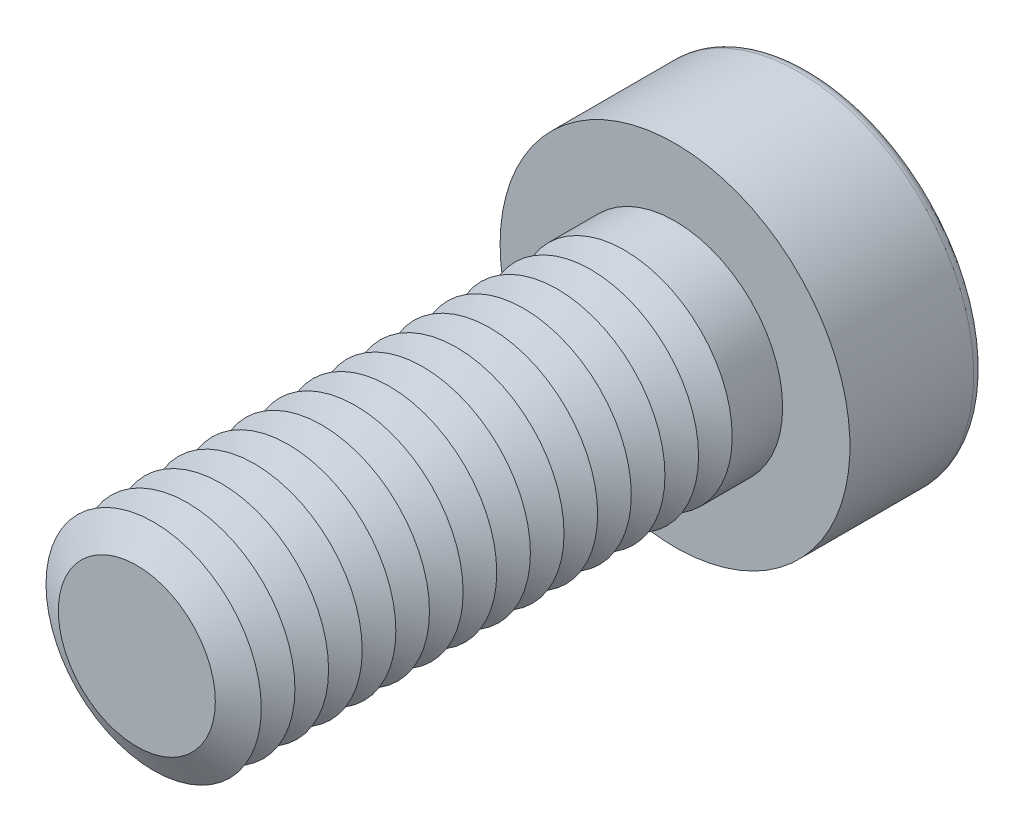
ISO-10303-21;
HEADER;
FILE_DESCRIPTION(('STEP AP214'),'2;1');
FILE_NAME('part.step','',(''),(''),'','','');
FILE_SCHEMA(('AUTOMOTIVE_DESIGN { 1 0 10303 214 1 1 1 1 }'));
ENDSEC;
DATA;
#1=APPLICATION_CONTEXT('core data for automotive mechanical design processes');
#2=APPLICATION_PROTOCOL_DEFINITION('international standard','automotive_design',2000,#1);
#3=PRODUCT_CONTEXT('',#1,'mechanical');
#4=PRODUCT('Part','Part','',(#3));
#5=PRODUCT_RELATED_PRODUCT_CATEGORY('part','',(#4));
#6=PRODUCT_DEFINITION_FORMATION('','',#4);
#7=PRODUCT_DEFINITION_CONTEXT('part definition',#1,'design');
#8=PRODUCT_DEFINITION('design','',#6,#7);
#9=PRODUCT_DEFINITION_SHAPE('','',#8);
#10=(LENGTH_UNIT() NAMED_UNIT(*) SI_UNIT(.MILLI.,.METRE.));
#11=(NAMED_UNIT(*) PLANE_ANGLE_UNIT() SI_UNIT($,.RADIAN.));
#12=(NAMED_UNIT(*) SI_UNIT($,.STERADIAN.) SOLID_ANGLE_UNIT());
#13=UNCERTAINTY_MEASURE_WITH_UNIT(LENGTH_MEASURE(1.E-05),#10,'distance_accuracy_value','');
#14=(GEOMETRIC_REPRESENTATION_CONTEXT(3) GLOBAL_UNCERTAINTY_ASSIGNED_CONTEXT((#13)) GLOBAL_UNIT_ASSIGNED_CONTEXT((#10,
#11,#12)) REPRESENTATION_CONTEXT('',''));
#15=CARTESIAN_POINT('',(0.,0.,0.));
#16=DIRECTION('',(0.,0.,1.));
#17=DIRECTION('',(1.,0.,0.));
#18=AXIS2_PLACEMENT_3D('',#15,#16,#17);
#19=CARTESIAN_POINT('',(0.,0.,15.625));
#20=DIRECTION('',(0.,0.,1.));
#21=DIRECTION('',(1.,0.,0.));
#22=AXIS2_PLACEMENT_3D('',#19,#20,#21);
#23=CONICAL_SURFACE('',#22,4.,1.0471975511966);
#24=CARTESIAN_POINT('',(0.,0.,15.));
#25=DIRECTION('',(0.,0.,1.));
#26=DIRECTION('',(1.,0.,0.));
#27=AXIS2_PLACEMENT_3D('',#24,#25,#26);
#28=CIRCLE('',#27,2.91746824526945);
#29=CARTESIAN_POINT('',(2.91746824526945,0.,15.));
#30=VERTEX_POINT('',#29);
#31=EDGE_CURVE('E313',#30,#30,#28,.T.);
#32=ORIENTED_EDGE('',*,*,#31,.T.);
#33=EDGE_LOOP('',(#32));
#34=FACE_BOUND('',#33,.T.);
#35=CARTESIAN_POINT('',(0.,0.,15.625));
#36=DIRECTION('',(0.,0.,1.));
#37=DIRECTION('',(1.,0.,0.));
#38=AXIS2_PLACEMENT_3D('',#35,#36,#37);
#39=CIRCLE('',#38,4.);
#40=CARTESIAN_POINT('',(4.,0.,15.625));
#41=VERTEX_POINT('',#40);
#42=EDGE_CURVE('E316',#41,#41,#39,.T.);
#43=ORIENTED_EDGE('',*,*,#42,.F.);
#44=EDGE_LOOP('',(#43));
#45=FACE_BOUND('',#44,.T.);
#46=ADVANCED_FACE('F39',(#34,#45),#23,.T.);
#47=CARTESIAN_POINT('',(0.,0.,15.));
#48=DIRECTION('',(0.,0.,-1.));
#49=DIRECTION('',(-1.,0.,0.));
#50=AXIS2_PLACEMENT_3D('',#47,#48,#49);
#51=CONICAL_SURFACE('',#50,2.91746824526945,1.0471975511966);
#52=CARTESIAN_POINT('',(0.,0.,14.375));
#53=DIRECTION('',(0.,0.,1.));
#54=DIRECTION('',(1.,0.,0.));
#55=AXIS2_PLACEMENT_3D('',#52,#53,#54);
#56=CIRCLE('',#55,4.);
#57=CARTESIAN_POINT('',(4.,0.,14.375));
#58=VERTEX_POINT('',#57);
#59=EDGE_CURVE('E324',#58,#58,#56,.T.);
#60=ORIENTED_EDGE('',*,*,#59,.T.);
#61=EDGE_LOOP('',(#60));
#62=FACE_BOUND('',#61,.T.);
#63=ORIENTED_EDGE('',*,*,#31,.F.);
#64=EDGE_LOOP('',(#63));
#65=FACE_BOUND('',#64,.T.);
#66=ADVANCED_FACE('F244',(#62,#65),#51,.T.);
#67=CARTESIAN_POINT('',(0.,0.,20.));
#68=DIRECTION('',(0.,0.,1.));
#69=DIRECTION('',(1.,0.,0.));
#70=AXIS2_PLACEMENT_3D('',#67,#68,#69);
#71=PLANE('',#70);
#72=CARTESIAN_POINT('',(0.,0.,20.));
#73=DIRECTION('',(0.,0.,1.));
#74=DIRECTION('',(1.,0.,0.));
#75=AXIS2_PLACEMENT_3D('',#72,#73,#74);
#76=CIRCLE('',#75,2.91746824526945);
#77=CARTESIAN_POINT('',(2.91746824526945,0.,20.));
#78=VERTEX_POINT('',#77);
#79=EDGE_CURVE('E173',#78,#78,#76,.T.);
#80=ORIENTED_EDGE('',*,*,#79,.T.);
#81=EDGE_LOOP('',(#80));
#82=FACE_BOUND('',#81,.T.);
#83=ADVANCED_FACE('F250',(#82),#71,.T.);
#84=CARTESIAN_POINT('',(0.,0.,20.));
#85=DIRECTION('',(0.,0.,-1.));
#86=DIRECTION('',(-1.,0.,0.));
#87=AXIS2_PLACEMENT_3D('',#84,#85,#86);
#88=CONICAL_SURFACE('',#87,2.91746824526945,1.0471975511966);
#89=CARTESIAN_POINT('',(0.,0.,19.375));
#90=DIRECTION('',(0.,0.,1.));
#91=DIRECTION('',(1.,0.,0.));
#92=AXIS2_PLACEMENT_3D('',#89,#90,#91);
#93=CIRCLE('',#92,4.);
#94=CARTESIAN_POINT('',(4.,0.,19.375));
#95=VERTEX_POINT('',#94);
#96=EDGE_CURVE('E290',#95,#95,#93,.T.);
#97=ORIENTED_EDGE('',*,*,#96,.T.);
#98=EDGE_LOOP('',(#97));
#99=FACE_BOUND('',#98,.T.);
#100=ORIENTED_EDGE('',*,*,#79,.F.);
#101=EDGE_LOOP('',(#100));
#102=FACE_BOUND('',#101,.T.);
#103=ADVANCED_FACE('F198',(#99,#102),#88,.T.);
#104=CARTESIAN_POINT('',(0.,0.,19.375));
#105=DIRECTION('',(0.,0.,1.));
#106=DIRECTION('',(1.,0.,0.));
#107=AXIS2_PLACEMENT_3D('',#104,#105,#106);
#108=CONICAL_SURFACE('',#107,4.,1.0471975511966);
#109=CARTESIAN_POINT('',(0.,0.,18.75));
#110=DIRECTION('',(0.,0.,1.));
#111=DIRECTION('',(1.,0.,0.));
#112=AXIS2_PLACEMENT_3D('',#109,#110,#111);
#113=CIRCLE('',#112,2.91746824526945);
#114=CARTESIAN_POINT('',(2.91746824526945,0.,18.75));
#115=VERTEX_POINT('',#114);
#116=EDGE_CURVE('E287',#115,#115,#113,.T.);
#117=ORIENTED_EDGE('',*,*,#116,.T.);
#118=EDGE_LOOP('',(#117));
#119=FACE_BOUND('',#118,.T.);
#120=ORIENTED_EDGE('',*,*,#96,.F.);
#121=EDGE_LOOP('',(#120));
#122=FACE_BOUND('',#121,.T.);
#123=ADVANCED_FACE('F276',(#119,#122),#108,.T.);
#124=CARTESIAN_POINT('',(0.,0.,18.75));
#125=DIRECTION('',(0.,0.,-1.));
#126=DIRECTION('',(-1.,0.,0.));
#127=AXIS2_PLACEMENT_3D('',#124,#125,#126);
#128=CONICAL_SURFACE('',#127,2.91746824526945,1.0471975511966);
#129=CARTESIAN_POINT('',(0.,0.,18.125));
#130=DIRECTION('',(0.,0.,1.));
#131=DIRECTION('',(1.,0.,0.));
#132=AXIS2_PLACEMENT_3D('',#129,#130,#131);
#133=CIRCLE('',#132,4.);
#134=CARTESIAN_POINT('',(4.,0.,18.125));
#135=VERTEX_POINT('',#134);
#136=EDGE_CURVE('E299',#135,#135,#133,.T.);
#137=ORIENTED_EDGE('',*,*,#136,.T.);
#138=EDGE_LOOP('',(#137));
#139=FACE_BOUND('',#138,.T.);
#140=ORIENTED_EDGE('',*,*,#116,.F.);
#141=EDGE_LOOP('',(#140));
#142=FACE_BOUND('',#141,.T.);
#143=ADVANCED_FACE('F273',(#139,#142),#128,.T.);
#144=CARTESIAN_POINT('',(0.,0.,18.125));
#145=DIRECTION('',(0.,0.,1.));
#146=DIRECTION('',(1.,0.,0.));
#147=AXIS2_PLACEMENT_3D('',#144,#145,#146);
#148=CONICAL_SURFACE('',#147,4.,1.0471975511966);
#149=CARTESIAN_POINT('',(0.,0.,17.5));
#150=DIRECTION('',(0.,0.,1.));
#151=DIRECTION('',(1.,0.,0.));
#152=AXIS2_PLACEMENT_3D('',#149,#150,#151);
#153=CIRCLE('',#152,2.91746824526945);
#154=CARTESIAN_POINT('',(2.91746824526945,0.,17.5));
#155=VERTEX_POINT('',#154);
#156=EDGE_CURVE('E292',#155,#155,#153,.T.);
#157=ORIENTED_EDGE('',*,*,#156,.T.);
#158=EDGE_LOOP('',(#157));
#159=FACE_BOUND('',#158,.T.);
#160=ORIENTED_EDGE('',*,*,#136,.F.);
#161=EDGE_LOOP('',(#160));
#162=FACE_BOUND('',#161,.T.);
#163=ADVANCED_FACE('F269',(#159,#162),#148,.T.);
#164=CARTESIAN_POINT('',(0.,0.,17.5));
#165=DIRECTION('',(0.,0.,-1.));
#166=DIRECTION('',(-1.,0.,0.));
#167=AXIS2_PLACEMENT_3D('',#164,#165,#166);
#168=CONICAL_SURFACE('',#167,2.91746824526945,1.0471975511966);
#169=CARTESIAN_POINT('',(0.,0.,16.875));
#170=DIRECTION('',(0.,0.,1.));
#171=DIRECTION('',(1.,0.,0.));
#172=AXIS2_PLACEMENT_3D('',#169,#170,#171);
#173=CIRCLE('',#172,4.);
#174=CARTESIAN_POINT('',(4.,0.,16.875));
#175=VERTEX_POINT('',#174);
#176=EDGE_CURVE('E309',#175,#175,#173,.T.);
#177=ORIENTED_EDGE('',*,*,#176,.T.);
#178=EDGE_LOOP('',(#177));
#179=FACE_BOUND('',#178,.T.);
#180=ORIENTED_EDGE('',*,*,#156,.F.);
#181=EDGE_LOOP('',(#180));
#182=FACE_BOUND('',#181,.T.);
#183=ADVANCED_FACE('F265',(#179,#182),#168,.T.);
#184=CARTESIAN_POINT('',(0.,0.,16.875));
#185=DIRECTION('',(0.,0.,1.));
#186=DIRECTION('',(1.,0.,0.));
#187=AXIS2_PLACEMENT_3D('',#184,#185,#186);
#188=CONICAL_SURFACE('',#187,4.,1.0471975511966);
#189=CARTESIAN_POINT('',(0.,0.,16.25));
#190=DIRECTION('',(0.,0.,1.));
#191=DIRECTION('',(1.,0.,0.));
#192=AXIS2_PLACEMENT_3D('',#189,#190,#191);
#193=CIRCLE('',#192,2.91746824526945);
#194=CARTESIAN_POINT('',(2.91746824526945,0.,16.25));
#195=VERTEX_POINT('',#194);
#196=EDGE_CURVE('E305',#195,#195,#193,.T.);
#197=ORIENTED_EDGE('',*,*,#196,.T.);
#198=EDGE_LOOP('',(#197));
#199=FACE_BOUND('',#198,.T.);
#200=ORIENTED_EDGE('',*,*,#176,.F.);
#201=EDGE_LOOP('',(#200));
#202=FACE_BOUND('',#201,.T.);
#203=ADVANCED_FACE('F261',(#199,#202),#188,.T.);
#204=CARTESIAN_POINT('',(0.,0.,16.25));
#205=DIRECTION('',(0.,0.,-1.));
#206=DIRECTION('',(-1.,0.,0.));
#207=AXIS2_PLACEMENT_3D('',#204,#205,#206);
#208=CONICAL_SURFACE('',#207,2.91746824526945,1.0471975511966);
#209=ORIENTED_EDGE('',*,*,#42,.T.);
#210=EDGE_LOOP('',(#209));
#211=FACE_BOUND('',#210,.T.);
#212=ORIENTED_EDGE('',*,*,#196,.F.);
#213=EDGE_LOOP('',(#212));
#214=FACE_BOUND('',#213,.T.);
#215=ADVANCED_FACE('F257',(#211,#214),#208,.T.);
#216=CARTESIAN_POINT('',(0.,0.,14.375));
#217=DIRECTION('',(0.,0.,1.));
#218=DIRECTION('',(1.,0.,0.));
#219=AXIS2_PLACEMENT_3D('',#216,#217,#218);
#220=CONICAL_SURFACE('',#219,4.,1.0471975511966);
#221=CARTESIAN_POINT('',(0.,0.,13.75));
#222=DIRECTION('',(0.,0.,1.));
#223=DIRECTION('',(1.,0.,0.));
#224=AXIS2_PLACEMENT_3D('',#221,#222,#223);
#225=CIRCLE('',#224,2.91746824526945);
#226=CARTESIAN_POINT('',(2.91746824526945,0.,13.75));
#227=VERTEX_POINT('',#226);
#228=EDGE_CURVE('E320',#227,#227,#225,.T.);
#229=ORIENTED_EDGE('',*,*,#228,.T.);
#230=EDGE_LOOP('',(#229));
#231=FACE_BOUND('',#230,.T.);
#232=ORIENTED_EDGE('',*,*,#59,.F.);
#233=EDGE_LOOP('',(#232));
#234=FACE_BOUND('',#233,.T.);
#235=ADVANCED_FACE('F260',(#231,#234),#220,.T.);
#236=CARTESIAN_POINT('',(0.,0.,13.75));
#237=DIRECTION('',(0.,0.,-1.));
#238=DIRECTION('',(-1.,0.,0.));
#239=AXIS2_PLACEMENT_3D('',#236,#237,#238);
#240=CONICAL_SURFACE('',#239,2.91746824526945,1.0471975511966);
#241=CARTESIAN_POINT('',(0.,0.,13.125));
#242=DIRECTION('',(0.,0.,1.));
#243=DIRECTION('',(1.,0.,0.));
#244=AXIS2_PLACEMENT_3D('',#241,#242,#243);
#245=CIRCLE('',#244,4.);
#246=CARTESIAN_POINT('',(4.,0.,13.125));
#247=VERTEX_POINT('',#246);
#248=EDGE_CURVE('E332',#247,#247,#245,.T.);
#249=ORIENTED_EDGE('',*,*,#248,.T.);
#250=EDGE_LOOP('',(#249));
#251=FACE_BOUND('',#250,.T.);
#252=ORIENTED_EDGE('',*,*,#228,.F.);
#253=EDGE_LOOP('',(#252));
#254=FACE_BOUND('',#253,.T.);
#255=ADVANCED_FACE('F480',(#251,#254),#240,.T.);
#256=CARTESIAN_POINT('',(0.,0.,13.125));
#257=DIRECTION('',(0.,0.,1.));
#258=DIRECTION('',(1.,0.,0.));
#259=AXIS2_PLACEMENT_3D('',#256,#257,#258);
#260=CONICAL_SURFACE('',#259,4.,1.0471975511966);
#261=CARTESIAN_POINT('',(0.,0.,12.5));
#262=DIRECTION('',(0.,0.,1.));
#263=DIRECTION('',(1.,0.,0.));
#264=AXIS2_PLACEMENT_3D('',#261,#262,#263);
#265=CIRCLE('',#264,2.91746824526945);
#266=CARTESIAN_POINT('',(2.91746824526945,0.,12.5));
#267=VERTEX_POINT('',#266);
#268=EDGE_CURVE('E328',#267,#267,#265,.T.);
#269=ORIENTED_EDGE('',*,*,#268,.T.);
#270=EDGE_LOOP('',(#269));
#271=FACE_BOUND('',#270,.T.);
#272=ORIENTED_EDGE('',*,*,#248,.F.);
#273=EDGE_LOOP('',(#272));
#274=FACE_BOUND('',#273,.T.);
#275=ADVANCED_FACE('F476',(#271,#274),#260,.T.);
#276=CARTESIAN_POINT('',(0.,0.,12.5));
#277=DIRECTION('',(0.,0.,-1.));
#278=DIRECTION('',(-1.,0.,0.));
#279=AXIS2_PLACEMENT_3D('',#276,#277,#278);
#280=CONICAL_SURFACE('',#279,2.91746824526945,1.0471975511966);
#281=CARTESIAN_POINT('',(0.,0.,11.875));
#282=DIRECTION('',(0.,0.,1.));
#283=DIRECTION('',(1.,0.,0.));
#284=AXIS2_PLACEMENT_3D('',#281,#282,#283);
#285=CIRCLE('',#284,4.);
#286=CARTESIAN_POINT('',(4.,0.,11.875));
#287=VERTEX_POINT('',#286);
#288=EDGE_CURVE('E339',#287,#287,#285,.T.);
#289=ORIENTED_EDGE('',*,*,#288,.T.);
#290=EDGE_LOOP('',(#289));
#291=FACE_BOUND('',#290,.T.);
#292=ORIENTED_EDGE('',*,*,#268,.F.);
#293=EDGE_LOOP('',(#292));
#294=FACE_BOUND('',#293,.T.);
#295=ADVANCED_FACE('F472',(#291,#294),#280,.T.);
#296=CARTESIAN_POINT('',(0.,0.,11.875));
#297=DIRECTION('',(0.,0.,1.));
#298=DIRECTION('',(1.,0.,0.));
#299=AXIS2_PLACEMENT_3D('',#296,#297,#298);
#300=CONICAL_SURFACE('',#299,4.,1.0471975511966);
#301=CARTESIAN_POINT('',(0.,0.,11.25));
#302=DIRECTION('',(0.,0.,1.));
#303=DIRECTION('',(1.,0.,0.));
#304=AXIS2_PLACEMENT_3D('',#301,#302,#303);
#305=CIRCLE('',#304,2.91746824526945);
#306=CARTESIAN_POINT('',(2.91746824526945,0.,11.25));
#307=VERTEX_POINT('',#306);
#308=EDGE_CURVE('E336',#307,#307,#305,.T.);
#309=ORIENTED_EDGE('',*,*,#308,.T.);
#310=EDGE_LOOP('',(#309));
#311=FACE_BOUND('',#310,.T.);
#312=ORIENTED_EDGE('',*,*,#288,.F.);
#313=EDGE_LOOP('',(#312));
#314=FACE_BOUND('',#313,.T.);
#315=ADVANCED_FACE('F468',(#311,#314),#300,.T.);
#316=CARTESIAN_POINT('',(0.,0.,11.25));
#317=DIRECTION('',(0.,0.,-1.));
#318=DIRECTION('',(-1.,0.,0.));
#319=AXIS2_PLACEMENT_3D('',#316,#317,#318);
#320=CONICAL_SURFACE('',#319,2.91746824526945,1.0471975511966);
#321=CARTESIAN_POINT('',(0.,0.,10.625));
#322=DIRECTION('',(0.,0.,1.));
#323=DIRECTION('',(1.,0.,0.));
#324=AXIS2_PLACEMENT_3D('',#321,#322,#323);
#325=CIRCLE('',#324,4.);
#326=CARTESIAN_POINT('',(4.,0.,10.625));
#327=VERTEX_POINT('',#326);
#328=EDGE_CURVE('E347',#327,#327,#325,.T.);
#329=ORIENTED_EDGE('',*,*,#328,.T.);
#330=EDGE_LOOP('',(#329));
#331=FACE_BOUND('',#330,.T.);
#332=ORIENTED_EDGE('',*,*,#308,.F.);
#333=EDGE_LOOP('',(#332));
#334=FACE_BOUND('',#333,.T.);
#335=ADVANCED_FACE('F464',(#331,#334),#320,.T.);
#336=CARTESIAN_POINT('',(0.,0.,10.625));
#337=DIRECTION('',(0.,0.,1.));
#338=DIRECTION('',(1.,0.,0.));
#339=AXIS2_PLACEMENT_3D('',#336,#337,#338);
#340=CONICAL_SURFACE('',#339,4.,1.0471975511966);
#341=CARTESIAN_POINT('',(0.,0.,10.));
#342=DIRECTION('',(0.,0.,1.));
#343=DIRECTION('',(1.,0.,0.));
#344=AXIS2_PLACEMENT_3D('',#341,#342,#343);
#345=CIRCLE('',#344,2.91746824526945);
#346=CARTESIAN_POINT('',(2.91746824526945,0.,10.));
#347=VERTEX_POINT('',#346);
#348=EDGE_CURVE('E343',#347,#347,#345,.T.);
#349=ORIENTED_EDGE('',*,*,#348,.T.);
#350=EDGE_LOOP('',(#349));
#351=FACE_BOUND('',#350,.T.);
#352=ORIENTED_EDGE('',*,*,#328,.F.);
#353=EDGE_LOOP('',(#352));
#354=FACE_BOUND('',#353,.T.);
#355=ADVANCED_FACE('F460',(#351,#354),#340,.T.);
#356=CARTESIAN_POINT('',(0.,0.,10.));
#357=DIRECTION('',(0.,0.,-1.));
#358=DIRECTION('',(-1.,0.,0.));
#359=AXIS2_PLACEMENT_3D('',#356,#357,#358);
#360=CONICAL_SURFACE('',#359,2.91746824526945,1.0471975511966);
#361=CARTESIAN_POINT('',(0.,0.,9.375));
#362=DIRECTION('',(0.,0.,1.));
#363=DIRECTION('',(1.,0.,0.));
#364=AXIS2_PLACEMENT_3D('',#361,#362,#363);
#365=CIRCLE('',#364,4.);
#366=CARTESIAN_POINT('',(4.,0.,9.375));
#367=VERTEX_POINT('',#366);
#368=EDGE_CURVE('E355',#367,#367,#365,.T.);
#369=ORIENTED_EDGE('',*,*,#368,.T.);
#370=EDGE_LOOP('',(#369));
#371=FACE_BOUND('',#370,.T.);
#372=ORIENTED_EDGE('',*,*,#348,.F.);
#373=EDGE_LOOP('',(#372));
#374=FACE_BOUND('',#373,.T.);
#375=ADVANCED_FACE('F456',(#371,#374),#360,.T.);
#376=CARTESIAN_POINT('',(0.,0.,9.375));
#377=DIRECTION('',(0.,0.,1.));
#378=DIRECTION('',(1.,0.,0.));
#379=AXIS2_PLACEMENT_3D('',#376,#377,#378);
#380=CONICAL_SURFACE('',#379,4.,1.0471975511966);
#381=CARTESIAN_POINT('',(0.,0.,8.75));
#382=DIRECTION('',(0.,0.,1.));
#383=DIRECTION('',(1.,0.,0.));
#384=AXIS2_PLACEMENT_3D('',#381,#382,#383);
#385=CIRCLE('',#384,2.91746824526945);
#386=CARTESIAN_POINT('',(2.91746824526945,0.,8.75));
#387=VERTEX_POINT('',#386);
#388=EDGE_CURVE('E351',#387,#387,#385,.T.);
#389=ORIENTED_EDGE('',*,*,#388,.T.);
#390=EDGE_LOOP('',(#389));
#391=FACE_BOUND('',#390,.T.);
#392=ORIENTED_EDGE('',*,*,#368,.F.);
#393=EDGE_LOOP('',(#392));
#394=FACE_BOUND('',#393,.T.);
#395=ADVANCED_FACE('F452',(#391,#394),#380,.T.);
#396=CARTESIAN_POINT('',(0.,0.,8.75));
#397=DIRECTION('',(0.,0.,-1.));
#398=DIRECTION('',(-1.,0.,0.));
#399=AXIS2_PLACEMENT_3D('',#396,#397,#398);
#400=CONICAL_SURFACE('',#399,2.91746824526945,1.0471975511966);
#401=CARTESIAN_POINT('',(0.,0.,8.125));
#402=DIRECTION('',(0.,0.,1.));
#403=DIRECTION('',(1.,0.,0.));
#404=AXIS2_PLACEMENT_3D('',#401,#402,#403);
#405=CIRCLE('',#404,4.);
#406=CARTESIAN_POINT('',(4.,0.,8.125));
#407=VERTEX_POINT('',#406);
#408=EDGE_CURVE('E363',#407,#407,#405,.T.);
#409=ORIENTED_EDGE('',*,*,#408,.T.);
#410=EDGE_LOOP('',(#409));
#411=FACE_BOUND('',#410,.T.);
#412=ORIENTED_EDGE('',*,*,#388,.F.);
#413=EDGE_LOOP('',(#412));
#414=FACE_BOUND('',#413,.T.);
#415=ADVANCED_FACE('F448',(#411,#414),#400,.T.);
#416=CARTESIAN_POINT('',(0.,0.,8.125));
#417=DIRECTION('',(0.,0.,1.));
#418=DIRECTION('',(1.,0.,0.));
#419=AXIS2_PLACEMENT_3D('',#416,#417,#418);
#420=CONICAL_SURFACE('',#419,4.,1.0471975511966);
#421=CARTESIAN_POINT('',(0.,0.,7.5));
#422=DIRECTION('',(0.,0.,1.));
#423=DIRECTION('',(1.,0.,0.));
#424=AXIS2_PLACEMENT_3D('',#421,#422,#423);
#425=CIRCLE('',#424,2.91746824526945);
#426=CARTESIAN_POINT('',(2.91746824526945,0.,7.5));
#427=VERTEX_POINT('',#426);
#428=EDGE_CURVE('E359',#427,#427,#425,.T.);
#429=ORIENTED_EDGE('',*,*,#428,.T.);
#430=EDGE_LOOP('',(#429));
#431=FACE_BOUND('',#430,.T.);
#432=ORIENTED_EDGE('',*,*,#408,.F.);
#433=EDGE_LOOP('',(#432));
#434=FACE_BOUND('',#433,.T.);
#435=ADVANCED_FACE('F444',(#431,#434),#420,.T.);
#436=CARTESIAN_POINT('',(0.,0.,7.5));
#437=DIRECTION('',(0.,0.,-1.));
#438=DIRECTION('',(-1.,0.,0.));
#439=AXIS2_PLACEMENT_3D('',#436,#437,#438);
#440=CONICAL_SURFACE('',#439,2.91746824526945,1.0471975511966);
#441=CARTESIAN_POINT('',(0.,0.,6.875));
#442=DIRECTION('',(0.,0.,1.));
#443=DIRECTION('',(1.,0.,0.));
#444=AXIS2_PLACEMENT_3D('',#441,#442,#443);
#445=CIRCLE('',#444,4.);
#446=CARTESIAN_POINT('',(4.,0.,6.875));
#447=VERTEX_POINT('',#446);
#448=EDGE_CURVE('E371',#447,#447,#445,.T.);
#449=ORIENTED_EDGE('',*,*,#448,.T.);
#450=EDGE_LOOP('',(#449));
#451=FACE_BOUND('',#450,.T.);
#452=ORIENTED_EDGE('',*,*,#428,.F.);
#453=EDGE_LOOP('',(#452));
#454=FACE_BOUND('',#453,.T.);
#455=ADVANCED_FACE('F440',(#451,#454),#440,.T.);
#456=CARTESIAN_POINT('',(0.,0.,6.875));
#457=DIRECTION('',(0.,0.,1.));
#458=DIRECTION('',(1.,0.,0.));
#459=AXIS2_PLACEMENT_3D('',#456,#457,#458);
#460=CONICAL_SURFACE('',#459,4.,1.0471975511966);
#461=CARTESIAN_POINT('',(0.,0.,6.25));
#462=DIRECTION('',(0.,0.,1.));
#463=DIRECTION('',(1.,0.,0.));
#464=AXIS2_PLACEMENT_3D('',#461,#462,#463);
#465=CIRCLE('',#464,2.91746824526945);
#466=CARTESIAN_POINT('',(2.91746824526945,0.,6.25));
#467=VERTEX_POINT('',#466);
#468=EDGE_CURVE('E367',#467,#467,#465,.T.);
#469=ORIENTED_EDGE('',*,*,#468,.T.);
#470=EDGE_LOOP('',(#469));
#471=FACE_BOUND('',#470,.T.);
#472=ORIENTED_EDGE('',*,*,#448,.F.);
#473=EDGE_LOOP('',(#472));
#474=FACE_BOUND('',#473,.T.);
#475=ADVANCED_FACE('F436',(#471,#474),#460,.T.);
#476=CARTESIAN_POINT('',(0.,0.,6.25));
#477=DIRECTION('',(0.,0.,-1.));
#478=DIRECTION('',(-1.,0.,0.));
#479=AXIS2_PLACEMENT_3D('',#476,#477,#478);
#480=CONICAL_SURFACE('',#479,2.91746824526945,1.0471975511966);
#481=CARTESIAN_POINT('',(0.,0.,5.625));
#482=DIRECTION('',(0.,0.,1.));
#483=DIRECTION('',(1.,0.,0.));
#484=AXIS2_PLACEMENT_3D('',#481,#482,#483);
#485=CIRCLE('',#484,4.);
#486=CARTESIAN_POINT('',(4.,0.,5.625));
#487=VERTEX_POINT('',#486);
#488=EDGE_CURVE('E379',#487,#487,#485,.T.);
#489=ORIENTED_EDGE('',*,*,#488,.T.);
#490=EDGE_LOOP('',(#489));
#491=FACE_BOUND('',#490,.T.);
#492=ORIENTED_EDGE('',*,*,#468,.F.);
#493=EDGE_LOOP('',(#492));
#494=FACE_BOUND('',#493,.T.);
#495=ADVANCED_FACE('F432',(#491,#494),#480,.T.);
#496=CARTESIAN_POINT('',(0.,0.,5.625));
#497=DIRECTION('',(0.,0.,1.));
#498=DIRECTION('',(1.,0.,0.));
#499=AXIS2_PLACEMENT_3D('',#496,#497,#498);
#500=CONICAL_SURFACE('',#499,4.,1.0471975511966);
#501=CARTESIAN_POINT('',(0.,0.,5.));
#502=DIRECTION('',(0.,0.,1.));
#503=DIRECTION('',(1.,0.,0.));
#504=AXIS2_PLACEMENT_3D('',#501,#502,#503);
#505=CIRCLE('',#504,2.91746824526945);
#506=CARTESIAN_POINT('',(2.91746824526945,0.,5.));
#507=VERTEX_POINT('',#506);
#508=EDGE_CURVE('E375',#507,#507,#505,.T.);
#509=ORIENTED_EDGE('',*,*,#508,.T.);
#510=EDGE_LOOP('',(#509));
#511=FACE_BOUND('',#510,.T.);
#512=ORIENTED_EDGE('',*,*,#488,.F.);
#513=EDGE_LOOP('',(#512));
#514=FACE_BOUND('',#513,.T.);
#515=ADVANCED_FACE('F428',(#511,#514),#500,.T.);
#516=CARTESIAN_POINT('',(0.,0.,5.));
#517=DIRECTION('',(0.,0.,-1.));
#518=DIRECTION('',(-1.,0.,0.));
#519=AXIS2_PLACEMENT_3D('',#516,#517,#518);
#520=CONICAL_SURFACE('',#519,2.91746824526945,1.0471975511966);
#521=CARTESIAN_POINT('',(0.,0.,4.375));
#522=DIRECTION('',(0.,0.,1.));
#523=DIRECTION('',(1.,0.,0.));
#524=AXIS2_PLACEMENT_3D('',#521,#522,#523);
#525=CIRCLE('',#524,4.);
#526=CARTESIAN_POINT('',(4.,0.,4.375));
#527=VERTEX_POINT('',#526);
#528=EDGE_CURVE('E387',#527,#527,#525,.T.);
#529=ORIENTED_EDGE('',*,*,#528,.T.);
#530=EDGE_LOOP('',(#529));
#531=FACE_BOUND('',#530,.T.);
#532=ORIENTED_EDGE('',*,*,#508,.F.);
#533=EDGE_LOOP('',(#532));
#534=FACE_BOUND('',#533,.T.);
#535=ADVANCED_FACE('F424',(#531,#534),#520,.T.);
#536=CARTESIAN_POINT('',(0.,0.,4.375));
#537=DIRECTION('',(0.,0.,1.));
#538=DIRECTION('',(1.,0.,0.));
#539=AXIS2_PLACEMENT_3D('',#536,#537,#538);
#540=CONICAL_SURFACE('',#539,4.,1.0471975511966);
#541=CARTESIAN_POINT('',(0.,0.,3.75));
#542=DIRECTION('',(0.,0.,1.));
#543=DIRECTION('',(1.,0.,0.));
#544=AXIS2_PLACEMENT_3D('',#541,#542,#543);
#545=CIRCLE('',#544,2.91746824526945);
#546=CARTESIAN_POINT('',(2.91746824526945,0.,3.75));
#547=VERTEX_POINT('',#546);
#548=EDGE_CURVE('E383',#547,#547,#545,.T.);
#549=ORIENTED_EDGE('',*,*,#548,.T.);
#550=EDGE_LOOP('',(#549));
#551=FACE_BOUND('',#550,.T.);
#552=ORIENTED_EDGE('',*,*,#528,.F.);
#553=EDGE_LOOP('',(#552));
#554=FACE_BOUND('',#553,.T.);
#555=ADVANCED_FACE('F419',(#551,#554),#540,.T.);
#556=CARTESIAN_POINT('',(0.,0.,3.75));
#557=DIRECTION('',(0.,0.,-1.));
#558=DIRECTION('',(-1.,0.,0.));
#559=AXIS2_PLACEMENT_3D('',#556,#557,#558);
#560=CONICAL_SURFACE('',#559,2.91746824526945,1.0471975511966);
#561=CARTESIAN_POINT('',(0.,0.,3.125));
#562=DIRECTION('',(0.,0.,1.));
#563=DIRECTION('',(1.,0.,0.));
#564=AXIS2_PLACEMENT_3D('',#561,#562,#563);
#565=CIRCLE('',#564,4.);
#566=CARTESIAN_POINT('',(4.,0.,3.125));
#567=VERTEX_POINT('',#566);
#568=EDGE_CURVE('E399',#567,#567,#565,.T.);
#569=ORIENTED_EDGE('',*,*,#568,.T.);
#570=EDGE_LOOP('',(#569));
#571=FACE_BOUND('',#570,.T.);
#572=ORIENTED_EDGE('',*,*,#548,.F.);
#573=EDGE_LOOP('',(#572));
#574=FACE_BOUND('',#573,.T.);
#575=ADVANCED_FACE('F405',(#571,#574),#560,.T.);
#576=CARTESIAN_POINT('',(0.,0.,3.125));
#577=DIRECTION('',(0.,0.,1.));
#578=DIRECTION('',(1.,0.,0.));
#579=AXIS2_PLACEMENT_3D('',#576,#577,#578);
#580=CONICAL_SURFACE('',#579,4.,1.0471975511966);
#581=CARTESIAN_POINT('',(0.,0.,2.5));
#582=DIRECTION('',(0.,0.,1.));
#583=DIRECTION('',(1.,0.,0.));
#584=AXIS2_PLACEMENT_3D('',#581,#582,#583);
#585=CIRCLE('',#584,2.91746824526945);
#586=CARTESIAN_POINT('',(2.91746824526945,0.,2.5));
#587=VERTEX_POINT('',#586);
#588=EDGE_CURVE('E391',#587,#587,#585,.T.);
#589=ORIENTED_EDGE('',*,*,#588,.T.);
#590=EDGE_LOOP('',(#589));
#591=FACE_BOUND('',#590,.T.);
#592=ORIENTED_EDGE('',*,*,#568,.F.);
#593=EDGE_LOOP('',(#592));
#594=FACE_BOUND('',#593,.T.);
#595=ADVANCED_FACE('F408',(#591,#594),#580,.T.);
#596=CARTESIAN_POINT('',(0.,0.,2.5));
#597=DIRECTION('',(0.,0.,-1.));
#598=DIRECTION('',(-1.,0.,0.));
#599=AXIS2_PLACEMENT_3D('',#596,#597,#598);
#600=CONICAL_SURFACE('',#599,2.91746824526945,1.0471975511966);
#601=CARTESIAN_POINT('',(0.,0.,1.875));
#602=DIRECTION('',(0.,0.,1.));
#603=DIRECTION('',(1.,0.,0.));
#604=AXIS2_PLACEMENT_3D('',#601,#602,#603);
#605=CIRCLE('',#604,4.);
#606=CARTESIAN_POINT('',(4.,0.,1.875));
#607=VERTEX_POINT('',#606);
#608=EDGE_CURVE('E395',#607,#607,#605,.T.);
#609=ORIENTED_EDGE('',*,*,#608,.T.);
#610=EDGE_LOOP('',(#609));
#611=FACE_BOUND('',#610,.T.);
#612=ORIENTED_EDGE('',*,*,#588,.F.);
#613=EDGE_LOOP('',(#612));
#614=FACE_BOUND('',#613,.T.);
#615=ADVANCED_FACE('F410',(#611,#614),#600,.T.);
#616=CARTESIAN_POINT('',(0.,0.,-1.25));
#617=DIRECTION('',(0.,0.,-1.));
#618=DIRECTION('',(-1.,0.,0.));
#619=AXIS2_PLACEMENT_3D('',#616,#617,#618);
#620=CONICAL_SURFACE('',#619,2.5,1.0471975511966);
#621=CARTESIAN_POINT('',(0.,0.,0.193375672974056));
#622=VERTEX_POINT('',#621);
#623=VERTEX_LOOP('',#622);
#624=FACE_BOUND('',#623,.T.);
#625=CARTESIAN_POINT('',(0.,0.,-1.25));
#626=DIRECTION('',(0.,0.,-1.));
#627=DIRECTION('',(-1.,0.,0.));
#628=AXIS2_PLACEMENT_3D('',#625,#626,#627);
#629=CIRCLE('',#628,2.5);
#630=CARTESIAN_POINT('',(-2.1650635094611,1.25,-1.25));
#631=VERTEX_POINT('',#630);
#632=CARTESIAN_POINT('',(0.,2.5,-1.25));
#633=VERTEX_POINT('',#632);
#634=EDGE_CURVE('E149',#631,#633,#629,.T.);
#635=ORIENTED_EDGE('',*,*,#634,.T.);
#636=CARTESIAN_POINT('',(0.,0.,-1.25));
#637=DIRECTION('',(0.,0.,-1.));
#638=DIRECTION('',(-1.,0.,0.));
#639=AXIS2_PLACEMENT_3D('',#636,#637,#638);
#640=CIRCLE('',#639,2.5);
#641=CARTESIAN_POINT('',(2.1650635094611,1.25,-1.25));
#642=VERTEX_POINT('',#641);
#643=EDGE_CURVE('E54',#633,#642,#640,.T.);
#644=ORIENTED_EDGE('',*,*,#643,.T.);
#645=CARTESIAN_POINT('',(2.1650635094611,-1.25,-1.25));
#646=VERTEX_POINT('',#645);
#647=EDGE_CURVE('E966',#642,#646,#640,.T.);
#648=ORIENTED_EDGE('',*,*,#647,.T.);
#649=CARTESIAN_POINT('',(0.,-2.5,-1.25));
#650=VERTEX_POINT('',#649);
#651=EDGE_CURVE('E964',#646,#650,#640,.T.);
#652=ORIENTED_EDGE('',*,*,#651,.T.);
#653=CARTESIAN_POINT('',(-2.1650635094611,-1.25,-1.25));
#654=VERTEX_POINT('',#653);
#655=EDGE_CURVE('E959',#650,#654,#640,.T.);
#656=ORIENTED_EDGE('',*,*,#655,.T.);
#657=EDGE_CURVE('E957',#654,#631,#640,.T.);
#658=ORIENTED_EDGE('',*,*,#657,.T.);
#659=EDGE_LOOP('',(#635,#644,#648,#652,#656,#658));
#660=FACE_BOUND('',#659,.T.);
#661=ADVANCED_FACE('F200',(#624,#660),#620,.F.);
#662=CARTESIAN_POINT('',(0.,0.,-1.25));
#663=DIRECTION('',(0.,0.,-1.));
#664=DIRECTION('',(-1.,0.,0.));
#665=AXIS2_PLACEMENT_3D('',#662,#663,#664);
#666=PLANE('',#665);
#667=ORIENTED_EDGE('',*,*,#643,.F.);
#668=DIRECTION('',(1.,0.,0.));
#669=VECTOR('',#668,1.);
#670=CARTESIAN_POINT('',(-1.44337567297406,2.5,-1.25));
#671=LINE('',#670,#669);
#672=CARTESIAN_POINT('',(1.44337567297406,2.5,-1.25));
#673=VERTEX_POINT('',#672);
#674=EDGE_CURVE('E1006',#633,#673,#671,.T.);
#675=ORIENTED_EDGE('',*,*,#674,.T.);
#676=DIRECTION('',(0.5,-0.866025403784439,0.));
#677=VECTOR('',#676,1.);
#678=CARTESIAN_POINT('',(1.44337567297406,2.5,-1.25));
#679=LINE('',#678,#677);
#680=EDGE_CURVE('E155',#673,#642,#679,.T.);
#681=ORIENTED_EDGE('',*,*,#680,.T.);
#682=EDGE_LOOP('',(#667,#675,#681));
#683=FACE_BOUND('',#682,.T.);
#684=ADVANCED_FACE('F563',(#683),#666,.T.);
#685=ORIENTED_EDGE('',*,*,#647,.F.);
#686=CARTESIAN_POINT('',(2.88675134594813,0.,-1.25));
#687=VERTEX_POINT('',#686);
#688=EDGE_CURVE('E1008',#642,#687,#679,.T.);
#689=ORIENTED_EDGE('',*,*,#688,.T.);
#690=DIRECTION('',(-0.5,-0.866025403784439,0.));
#691=VECTOR('',#690,1.);
#692=CARTESIAN_POINT('',(2.88675134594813,0.,-1.25));
#693=LINE('',#692,#691);
#694=EDGE_CURVE('E980',#687,#646,#693,.T.);
#695=ORIENTED_EDGE('',*,*,#694,.T.);
#696=EDGE_LOOP('',(#685,#689,#695));
#697=FACE_BOUND('',#696,.T.);
#698=ADVANCED_FACE('F573',(#697),#666,.T.);
#699=ORIENTED_EDGE('',*,*,#651,.F.);
#700=CARTESIAN_POINT('',(1.44337567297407,-2.5,-1.25));
#701=VERTEX_POINT('',#700);
#702=EDGE_CURVE('E982',#646,#701,#693,.T.);
#703=ORIENTED_EDGE('',*,*,#702,.T.);
#704=DIRECTION('',(-1.,0.,0.));
#705=VECTOR('',#704,1.);
#706=CARTESIAN_POINT('',(1.44337567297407,-2.5,-1.25));
#707=LINE('',#706,#705);
#708=EDGE_CURVE('E932',#701,#650,#707,.T.);
#709=ORIENTED_EDGE('',*,*,#708,.T.);
#710=EDGE_LOOP('',(#699,#703,#709));
#711=FACE_BOUND('',#710,.T.);
#712=ADVANCED_FACE('F583',(#711),#666,.T.);
#713=ORIENTED_EDGE('',*,*,#655,.F.);
#714=CARTESIAN_POINT('',(-1.44337567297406,-2.5,-1.25));
#715=VERTEX_POINT('',#714);
#716=EDGE_CURVE('E976',#650,#715,#707,.T.);
#717=ORIENTED_EDGE('',*,*,#716,.T.);
#718=DIRECTION('',(-0.5,0.866025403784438,0.));
#719=VECTOR('',#718,1.);
#720=CARTESIAN_POINT('',(-1.44337567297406,-2.5,-1.25));
#721=LINE('',#720,#719);
#722=EDGE_CURVE('E978',#715,#654,#721,.T.);
#723=ORIENTED_EDGE('',*,*,#722,.T.);
#724=EDGE_LOOP('',(#713,#717,#723));
#725=FACE_BOUND('',#724,.T.);
#726=ADVANCED_FACE('F591',(#725),#666,.T.);
#727=ORIENTED_EDGE('',*,*,#657,.F.);
#728=CARTESIAN_POINT('',(-2.88675134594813,0.,-1.25));
#729=VERTEX_POINT('',#728);
#730=EDGE_CURVE('E983',#654,#729,#721,.T.);
#731=ORIENTED_EDGE('',*,*,#730,.T.);
#732=DIRECTION('',(0.5,0.866025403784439,0.));
#733=VECTOR('',#732,1.);
#734=CARTESIAN_POINT('',(-2.88675134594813,0.,-1.25));
#735=LINE('',#734,#733);
#736=EDGE_CURVE('E158',#729,#631,#735,.T.);
#737=ORIENTED_EDGE('',*,*,#736,.T.);
#738=EDGE_LOOP('',(#727,#731,#737));
#739=FACE_BOUND('',#738,.T.);
#740=ADVANCED_FACE('F230',(#739),#666,.T.);
#741=ORIENTED_EDGE('',*,*,#634,.F.);
#742=CARTESIAN_POINT('',(-1.44337567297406,2.5,-1.25));
#743=VERTEX_POINT('',#742);
#744=EDGE_CURVE('E990',#631,#743,#735,.T.);
#745=ORIENTED_EDGE('',*,*,#744,.T.);
#746=EDGE_CURVE('E1005',#743,#633,#671,.T.);
#747=ORIENTED_EDGE('',*,*,#746,.T.);
#748=EDGE_LOOP('',(#741,#745,#747));
#749=FACE_BOUND('',#748,.T.);
#750=ADVANCED_FACE('F575',(#749),#666,.T.);
#751=CARTESIAN_POINT('',(-1.44337567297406,2.5,-1.25));
#752=DIRECTION('',(0.,1.,0.));
#753=DIRECTION('',(-1.,0.,0.));
#754=AXIS2_PLACEMENT_3D('',#751,#752,#753);
#755=PLANE('',#754);
#756=DIRECTION('',(0.,0.,-1.));
#757=VECTOR('',#756,1.);
#758=CARTESIAN_POINT('',(-1.44337567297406,2.5,-1.25));
#759=LINE('',#758,#757);
#760=CARTESIAN_POINT('',(-1.44337567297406,2.5,-5.));
#761=VERTEX_POINT('',#760);
#762=EDGE_CURVE('E147',#743,#761,#759,.T.);
#763=ORIENTED_EDGE('',*,*,#762,.T.);
#764=CARTESIAN_POINT('',(-3.76800948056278,2.5,-5.43814611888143));
#765=CARTESIAN_POINT('',(-3.65512241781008,2.5,-5.41294788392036));
#766=CARTESIAN_POINT('',(-3.54216337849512,2.5,-5.38806689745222));
#767=CARTESIAN_POINT('',(-3.31606595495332,2.5,-5.33910944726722));
#768=CARTESIAN_POINT('',(-3.202927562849,2.5,-5.31503301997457));
#769=CARTESIAN_POINT('',(-2.97632910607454,2.5,-5.26783262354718));
#770=CARTESIAN_POINT('',(-2.86286882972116,2.5,-5.24470966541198));
#771=CARTESIAN_POINT('',(-2.63570880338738,2.5,-5.19967851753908));
#772=CARTESIAN_POINT('',(-2.522009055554,2.5,-5.17777031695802));
#773=CARTESIAN_POINT('',(-2.18246936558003,2.5,-5.11464083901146));
#774=CARTESIAN_POINT('',(-1.95621666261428,2.5,-5.07559469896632));
#775=CARTESIAN_POINT('',(-1.50233128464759,2.5,-5.00642421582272));
#776=CARTESIAN_POINT('',(-1.27469889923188,2.5,-4.97629806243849));
#777=CARTESIAN_POINT('',(-0.930935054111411,2.5,-4.9407375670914));
#778=CARTESIAN_POINT('',(-0.815306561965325,2.5,-4.93045885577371));
#779=CARTESIAN_POINT('',(-0.583775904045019,2.5,-4.91374261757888));
#780=CARTESIAN_POINT('',(-0.467873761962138,2.5,-4.9073047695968));
#781=CARTESIAN_POINT('',(-0.235955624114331,2.5,-4.89864425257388));
#782=CARTESIAN_POINT('',(-0.119939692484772,2.5,-4.89641989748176));
#783=CARTESIAN_POINT('',(0.11209426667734,2.5,-4.89632233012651));
#784=CARTESIAN_POINT('',(0.228112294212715,2.5,-4.89844912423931));
#785=CARTESIAN_POINT('',(0.460464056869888,2.5,-4.90693624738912));
#786=CARTESIAN_POINT('',(0.576797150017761,2.5,-4.91331380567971));
#787=CARTESIAN_POINT('',(0.809186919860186,2.5,-4.92994602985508));
#788=CARTESIAN_POINT('',(0.925243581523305,2.5,-4.94020090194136));
#789=CARTESIAN_POINT('',(1.1570783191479,2.5,-4.96408095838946));
#790=CARTESIAN_POINT('',(1.27285617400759,2.5,-4.97770825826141));
#791=CARTESIAN_POINT('',(1.50403978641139,2.5,-5.0077859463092));
#792=CARTESIAN_POINT('',(1.61944554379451,2.5,-5.02423633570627));
#793=CARTESIAN_POINT('',(1.97116037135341,2.5,-5.07794848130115));
#794=CARTESIAN_POINT('',(2.20690405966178,2.5,-5.11889404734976));
#795=CARTESIAN_POINT('',(2.67723558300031,2.5,-5.2069642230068));
#796=CARTESIAN_POINT('',(2.9118232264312,2.5,-5.25408982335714));
#797=CARTESIAN_POINT('',(3.38022088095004,2.5,-5.35235327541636));
#798=CARTESIAN_POINT('',(3.61403064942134,2.5,-5.40349227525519));
#799=CARTESIAN_POINT('',(4.08105387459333,2.5,-5.50842823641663));
#800=CARTESIAN_POINT('',(4.31426731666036,2.5,-5.56222526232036));
#801=CARTESIAN_POINT('',(4.77742011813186,2.5,-5.67097662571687));
#802=CARTESIAN_POINT('',(5.00736469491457,2.5,-5.72590882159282));
#803=CARTESIAN_POINT('',(5.46695141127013,2.5,-5.83704335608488));
#804=CARTESIAN_POINT('',(5.69659354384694,2.5,-5.89324572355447));
#805=CARTESIAN_POINT('',(6.15532898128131,2.5,-6.00649703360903));
#806=CARTESIAN_POINT('',(6.3844226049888,2.5,-6.06354468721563));
#807=CARTESIAN_POINT('',(6.84242442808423,2.5,-6.17834514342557));
#808=CARTESIAN_POINT('',(7.07133263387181,2.5,-6.23609792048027));
#809=CARTESIAN_POINT('',(7.30017784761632,2.5,-6.29409642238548));
#810=B_SPLINE_CURVE_WITH_KNOTS('',3,(#764,#765,#766,#767,#768,#769,#770,#771,#772,#773,#774,
#775,#776,#777,#778,#779,#780,#781,#782,#783,#784,#785,#786,#787,#788,#789,#790,#791,#792,#793,
#794,#795,#796,#797,#798,#799,#800,#801,#802,#803,#804,#805,#806,#807,#808,#809),.UNSPECIFIED.,
.F.,.F.,(4,2,2,2,2,2,2,2,2,2,2,2,2,2,2,2,2,2,2,2,2,2,4),(0.,0.346996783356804,0.694009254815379,
1.04138068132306,1.38874900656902,2.07743762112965,2.76598637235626,3.11418615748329,
3.46235682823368,3.81038814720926,4.15841997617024,4.50787110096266,4.85734081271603,
5.2070303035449,5.55671994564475,6.27438533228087,6.99216591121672,7.71015258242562,
8.42815670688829,9.13739674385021,9.84665290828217,10.5549206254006,11.2631627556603),.UNSPECIFIED.);
#811=CARTESIAN_POINT('',(1.44337567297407,2.5,-5.));
#812=VERTEX_POINT('',#811);
#813=EDGE_CURVE('E124',#761,#812,#810,.T.);
#814=ORIENTED_EDGE('',*,*,#813,.T.);
#815=DIRECTION('',(0.,0.,-1.));
#816=VECTOR('',#815,1.);
#817=CARTESIAN_POINT('',(1.44337567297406,2.5,-1.25));
#818=LINE('',#817,#816);
#819=EDGE_CURVE('E143',#673,#812,#818,.T.);
#820=ORIENTED_EDGE('',*,*,#819,.F.);
#821=ORIENTED_EDGE('',*,*,#674,.F.);
#822=ORIENTED_EDGE('',*,*,#746,.F.);
#823=EDGE_LOOP('',(#763,#814,#820,#821,#822));
#824=FACE_BOUND('',#823,.T.);
#825=ADVANCED_FACE('F141',(#824),#755,.F.);
#826=CARTESIAN_POINT('',(1.44337567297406,2.5,-1.25));
#827=DIRECTION('',(0.866025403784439,0.5,0.));
#828=DIRECTION('',(-0.5,0.866025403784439,0.));
#829=AXIS2_PLACEMENT_3D('',#826,#827,#828);
#830=PLANE('',#829);
#831=ORIENTED_EDGE('',*,*,#819,.T.);
#832=CARTESIAN_POINT('',(1.44326020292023,2.5002,-5.00003094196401));
#833=CARTESIAN_POINT('',(1.50320952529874,2.3963647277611,-4.98395956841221));
#834=CARTESIAN_POINT('',(1.56326755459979,2.29234116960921,-4.96936932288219));
#835=CARTESIAN_POINT('',(1.68359574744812,2.08392662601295,-4.94373552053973));
#836=CARTESIAN_POINT('',(1.7438659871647,1.97953550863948,-4.93269340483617));
#837=CARTESIAN_POINT('',(1.86425311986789,1.77101887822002,-4.91480059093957));
#838=CARTESIAN_POINT('',(1.9243691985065,1.66689477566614,-4.90792855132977));
#839=CARTESIAN_POINT('',(2.04467803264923,1.45851376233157,-4.89871383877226));
#840=CARTESIAN_POINT('',(2.10487077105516,1.35425688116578,-4.89637028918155));
#841=CARTESIAN_POINT('',(2.22525624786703,1.14574311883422,-4.89637028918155));
#842=CARTESIAN_POINT('',(2.28544898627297,1.04148623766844,-4.89871383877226));
#843=CARTESIAN_POINT('',(2.40575782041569,0.833105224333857,-4.90792855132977));
#844=CARTESIAN_POINT('',(2.4658738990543,0.728981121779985,-4.91480059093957));
#845=CARTESIAN_POINT('',(2.58626103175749,0.520464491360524,-4.93269340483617));
#846=CARTESIAN_POINT('',(2.64653127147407,0.416073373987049,-4.94373552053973));
#847=CARTESIAN_POINT('',(2.7668594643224,0.207658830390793,-4.96936932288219));
#848=CARTESIAN_POINT('',(2.82691749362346,0.103635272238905,-4.98395956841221));
#849=CARTESIAN_POINT('',(2.88686681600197,-0.000199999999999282,-5.00003094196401));
#850=B_SPLINE_CURVE_WITH_KNOTS('',3,(#832,#833,#834,#835,#836,#837,#838,#839,#840,#841,#842,
#843,#844,#845,#846,#847,#848,#849),.UNSPECIFIED.,.F.,.F.,(4,2,2,2,2,2,2,2,4),(0.,
0.362931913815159,0.726011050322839,1.08721601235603,1.44835104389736,1.80948607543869,
2.17069103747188,2.53377017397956,2.89670208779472),.UNSPECIFIED.);
#851=CARTESIAN_POINT('',(2.88675134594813,0.,-5.));
#852=VERTEX_POINT('',#851);
#853=EDGE_CURVE('E11',#812,#852,#850,.T.);
#854=ORIENTED_EDGE('',*,*,#853,.T.);
#855=DIRECTION('',(0.,0.,-1.));
#856=VECTOR('',#855,1.);
#857=CARTESIAN_POINT('',(2.88675134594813,0.,-1.25));
#858=LINE('',#857,#856);
#859=EDGE_CURVE('E157',#687,#852,#858,.T.);
#860=ORIENTED_EDGE('',*,*,#859,.F.);
#861=ORIENTED_EDGE('',*,*,#688,.F.);
#862=ORIENTED_EDGE('',*,*,#680,.F.);
#863=EDGE_LOOP('',(#831,#854,#860,#861,#862));
#864=FACE_BOUND('',#863,.T.);
#865=ADVANCED_FACE('F152',(#864),#830,.F.);
#866=CARTESIAN_POINT('',(2.88675134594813,0.,-1.25));
#867=DIRECTION('',(0.866025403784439,-0.5,0.));
#868=DIRECTION('',(0.5,0.866025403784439,0.));
#869=AXIS2_PLACEMENT_3D('',#866,#867,#868);
#870=PLANE('',#869);
#871=ORIENTED_EDGE('',*,*,#859,.T.);
#872=CARTESIAN_POINT('',(2.88686681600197,0.000200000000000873,-5.00003094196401));
#873=CARTESIAN_POINT('',(2.82691749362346,-0.103635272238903,-4.98395956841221));
#874=CARTESIAN_POINT('',(2.7668594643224,-0.207658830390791,-4.96936932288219));
#875=CARTESIAN_POINT('',(2.64653127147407,-0.416073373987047,-4.94373552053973));
#876=CARTESIAN_POINT('',(2.58626103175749,-0.520464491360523,-4.93269340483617));
#877=CARTESIAN_POINT('',(2.4658738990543,-0.728981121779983,-4.91480059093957));
#878=CARTESIAN_POINT('',(2.40575782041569,-0.833105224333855,-4.90792855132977));
#879=CARTESIAN_POINT('',(2.28544898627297,-1.04148623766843,-4.89871383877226));
#880=CARTESIAN_POINT('',(2.22525624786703,-1.14574311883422,-4.89637028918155));
#881=CARTESIAN_POINT('',(2.10487077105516,-1.35425688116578,-4.89637028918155));
#882=CARTESIAN_POINT('',(2.04467803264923,-1.45851376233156,-4.89871383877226));
#883=CARTESIAN_POINT('',(1.9243691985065,-1.66689477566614,-4.90792855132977));
#884=CARTESIAN_POINT('',(1.86425311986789,-1.77101887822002,-4.91480059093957));
#885=CARTESIAN_POINT('',(1.74386598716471,-1.97953550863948,-4.93269340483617));
#886=CARTESIAN_POINT('',(1.68359574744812,-2.08392662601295,-4.94373552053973));
#887=CARTESIAN_POINT('',(1.56326755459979,-2.29234116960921,-4.96936932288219));
#888=CARTESIAN_POINT('',(1.50320952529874,-2.3963647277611,-4.98395956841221));
#889=CARTESIAN_POINT('',(1.44326020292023,-2.5002,-5.00003094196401));
#890=B_SPLINE_CURVE_WITH_KNOTS('',3,(#872,#873,#874,#875,#876,#877,#878,#879,#880,#881,#882,
#883,#884,#885,#886,#887,#888,#889),.UNSPECIFIED.,.F.,.F.,(4,2,2,2,2,2,2,2,4),(0.,
0.362931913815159,0.726011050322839,1.08721601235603,1.44835104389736,1.80948607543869,
2.17069103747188,2.53377017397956,2.89670208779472),.UNSPECIFIED.);
#891=CARTESIAN_POINT('',(1.44337567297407,-2.5,-5.));
#892=VERTEX_POINT('',#891);
#893=EDGE_CURVE('E172',#852,#892,#890,.T.);
#894=ORIENTED_EDGE('',*,*,#893,.T.);
#895=DIRECTION('',(0.,0.,-1.));
#896=VECTOR('',#895,1.);
#897=CARTESIAN_POINT('',(1.44337567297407,-2.5,-1.25));
#898=LINE('',#897,#896);
#899=EDGE_CURVE('E927',#701,#892,#898,.T.);
#900=ORIENTED_EDGE('',*,*,#899,.F.);
#901=ORIENTED_EDGE('',*,*,#702,.F.);
#902=ORIENTED_EDGE('',*,*,#694,.F.);
#903=EDGE_LOOP('',(#871,#894,#900,#901,#902));
#904=FACE_BOUND('',#903,.T.);
#905=ADVANCED_FACE('F190',(#904),#870,.F.);
#906=CARTESIAN_POINT('',(1.44337567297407,-2.5,-1.25));
#907=DIRECTION('',(0.,-1.,0.));
#908=DIRECTION('',(1.,0.,0.));
#909=AXIS2_PLACEMENT_3D('',#906,#907,#908);
#910=PLANE('',#909);
#911=ORIENTED_EDGE('',*,*,#899,.T.);
#912=CARTESIAN_POINT('',(-3.76800948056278,-2.5,-5.43814611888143));
#913=CARTESIAN_POINT('',(-3.65512241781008,-2.5,-5.41294788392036));
#914=CARTESIAN_POINT('',(-3.54216337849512,-2.5,-5.38806689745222));
#915=CARTESIAN_POINT('',(-3.31606595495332,-2.5,-5.33910944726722));
#916=CARTESIAN_POINT('',(-3.202927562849,-2.5,-5.31503301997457));
#917=CARTESIAN_POINT('',(-2.97632910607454,-2.5,-5.26783262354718));
#918=CARTESIAN_POINT('',(-2.86286882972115,-2.5,-5.24470966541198));
#919=CARTESIAN_POINT('',(-2.63570880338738,-2.5,-5.19967851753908));
#920=CARTESIAN_POINT('',(-2.522009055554,-2.5,-5.17777031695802));
#921=CARTESIAN_POINT('',(-2.18246936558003,-2.5,-5.11464083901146));
#922=CARTESIAN_POINT('',(-1.95621666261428,-2.5,-5.07559469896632));
#923=CARTESIAN_POINT('',(-1.50233128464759,-2.5,-5.00642421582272));
#924=CARTESIAN_POINT('',(-1.27469889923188,-2.5,-4.97629806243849));
#925=CARTESIAN_POINT('',(-0.930935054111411,-2.5,-4.9407375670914));
#926=CARTESIAN_POINT('',(-0.815306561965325,-2.5,-4.93045885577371));
#927=CARTESIAN_POINT('',(-0.583775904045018,-2.5,-4.91374261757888));
#928=CARTESIAN_POINT('',(-0.467873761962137,-2.5,-4.9073047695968));
#929=CARTESIAN_POINT('',(-0.23595562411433,-2.5,-4.89864425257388));
#930=CARTESIAN_POINT('',(-0.119939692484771,-2.5,-4.89641989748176));
#931=CARTESIAN_POINT('',(0.112094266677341,-2.5,-4.89632233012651));
#932=CARTESIAN_POINT('',(0.228112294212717,-2.5,-4.89844912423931));
#933=CARTESIAN_POINT('',(0.460464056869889,-2.5,-4.90693624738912));
#934=CARTESIAN_POINT('',(0.576797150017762,-2.5,-4.91331380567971));
#935=CARTESIAN_POINT('',(0.809186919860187,-2.5,-4.92994602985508));
#936=CARTESIAN_POINT('',(0.925243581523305,-2.5,-4.94020090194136));
#937=CARTESIAN_POINT('',(1.1570783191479,-2.5,-4.96408095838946));
#938=CARTESIAN_POINT('',(1.27285617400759,-2.5,-4.97770825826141));
#939=CARTESIAN_POINT('',(1.50403978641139,-2.5,-5.0077859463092));
#940=CARTESIAN_POINT('',(1.61944554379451,-2.5,-5.02423633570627));
#941=CARTESIAN_POINT('',(1.97116037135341,-2.5,-5.07794848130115));
#942=CARTESIAN_POINT('',(2.20690405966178,-2.5,-5.11889404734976));
#943=CARTESIAN_POINT('',(2.67723558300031,-2.5,-5.2069642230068));
#944=CARTESIAN_POINT('',(2.9118232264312,-2.5,-5.25408982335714));
#945=CARTESIAN_POINT('',(3.38022088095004,-2.5,-5.35235327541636));
#946=CARTESIAN_POINT('',(3.61403064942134,-2.5,-5.40349227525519));
#947=CARTESIAN_POINT('',(4.08105387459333,-2.5,-5.50842823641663));
#948=CARTESIAN_POINT('',(4.31426731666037,-2.5,-5.56222526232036));
#949=CARTESIAN_POINT('',(4.77742011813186,-2.5,-5.67097662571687));
#950=CARTESIAN_POINT('',(5.00736469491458,-2.5,-5.72590882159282));
#951=CARTESIAN_POINT('',(5.46695141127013,-2.5,-5.83704335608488));
#952=CARTESIAN_POINT('',(5.69659354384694,-2.5,-5.89324572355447));
#953=CARTESIAN_POINT('',(6.15532898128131,-2.5,-6.00649703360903));
#954=CARTESIAN_POINT('',(6.38442260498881,-2.5,-6.06354468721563));
#955=CARTESIAN_POINT('',(6.84242442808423,-2.5,-6.17834514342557));
#956=CARTESIAN_POINT('',(7.07133263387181,-2.5,-6.23609792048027));
#957=CARTESIAN_POINT('',(7.30017784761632,-2.5,-6.29409642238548));
#958=B_SPLINE_CURVE_WITH_KNOTS('',3,(#912,#913,#914,#915,#916,#917,#918,#919,#920,#921,#922,
#923,#924,#925,#926,#927,#928,#929,#930,#931,#932,#933,#934,#935,#936,#937,#938,#939,#940,#941,
#942,#943,#944,#945,#946,#947,#948,#949,#950,#951,#952,#953,#954,#955,#956,#957),.UNSPECIFIED.,
.F.,.F.,(4,2,2,2,2,2,2,2,2,2,2,2,2,2,2,2,2,2,2,2,2,2,4),(0.,0.346996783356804,0.69400925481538,
1.04138068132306,1.38874900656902,2.07743762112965,2.76598637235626,3.11418615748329,
3.46235682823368,3.81038814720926,4.15841997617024,4.50787110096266,4.85734081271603,
5.20703030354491,5.55671994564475,6.27438533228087,6.99216591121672,7.71015258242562,
8.42815670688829,9.13739674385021,9.84665290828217,10.5549206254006,11.2631627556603),.UNSPECIFIED.);
#959=CARTESIAN_POINT('',(-1.44337567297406,-2.5,-5.));
#960=VERTEX_POINT('',#959);
#961=EDGE_CURVE('E183',#892,#960,#958,.F.);
#962=ORIENTED_EDGE('',*,*,#961,.T.);
#963=DIRECTION('',(0.,0.,-1.));
#964=VECTOR('',#963,1.);
#965=CARTESIAN_POINT('',(-1.44337567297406,-2.5,-1.25));
#966=LINE('',#965,#964);
#967=EDGE_CURVE('E934',#715,#960,#966,.T.);
#968=ORIENTED_EDGE('',*,*,#967,.F.);
#969=ORIENTED_EDGE('',*,*,#716,.F.);
#970=ORIENTED_EDGE('',*,*,#708,.F.);
#971=EDGE_LOOP('',(#911,#962,#968,#969,#970));
#972=FACE_BOUND('',#971,.T.);
#973=ADVANCED_FACE('F233',(#972),#910,.F.);
#974=CARTESIAN_POINT('',(-1.44337567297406,-2.5,-1.25));
#975=DIRECTION('',(-0.866025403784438,-0.5,0.));
#976=DIRECTION('',(0.5,-0.866025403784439,0.));
#977=AXIS2_PLACEMENT_3D('',#974,#975,#976);
#978=PLANE('',#977);
#979=ORIENTED_EDGE('',*,*,#967,.T.);
#980=CARTESIAN_POINT('',(-1.44326020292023,-2.5002,-5.00003094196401));
#981=CARTESIAN_POINT('',(-1.50320952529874,-2.3963647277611,-4.98395956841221));
#982=CARTESIAN_POINT('',(-1.56326755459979,-2.29234116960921,-4.96936932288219));
#983=CARTESIAN_POINT('',(-1.68359574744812,-2.08392662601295,-4.94373552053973));
#984=CARTESIAN_POINT('',(-1.7438659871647,-1.97953550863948,-4.93269340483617));
#985=CARTESIAN_POINT('',(-1.86425311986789,-1.77101887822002,-4.91480059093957));
#986=CARTESIAN_POINT('',(-1.9243691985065,-1.66689477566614,-4.90792855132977));
#987=CARTESIAN_POINT('',(-2.04467803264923,-1.45851376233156,-4.89871383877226));
#988=CARTESIAN_POINT('',(-2.10487077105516,-1.35425688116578,-4.89637028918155));
#989=CARTESIAN_POINT('',(-2.22525624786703,-1.14574311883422,-4.89637028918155));
#990=CARTESIAN_POINT('',(-2.28544898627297,-1.04148623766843,-4.89871383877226));
#991=CARTESIAN_POINT('',(-2.40575782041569,-0.833105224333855,-4.90792855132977));
#992=CARTESIAN_POINT('',(-2.4658738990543,-0.728981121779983,-4.91480059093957));
#993=CARTESIAN_POINT('',(-2.58626103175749,-0.520464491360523,-4.93269340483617));
#994=CARTESIAN_POINT('',(-2.64653127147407,-0.416073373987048,-4.94373552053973));
#995=CARTESIAN_POINT('',(-2.7668594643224,-0.207658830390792,-4.96936932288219));
#996=CARTESIAN_POINT('',(-2.82691749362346,-0.103635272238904,-4.98395956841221));
#997=CARTESIAN_POINT('',(-2.88686681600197,0.000199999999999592,-5.00003094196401));
#998=B_SPLINE_CURVE_WITH_KNOTS('',3,(#980,#981,#982,#983,#984,#985,#986,#987,#988,#989,#990,
#991,#992,#993,#994,#995,#996,#997),.UNSPECIFIED.,.F.,.F.,(4,2,2,2,2,2,2,2,4),(0.,
0.362931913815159,0.726011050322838,1.08721601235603,1.44835104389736,1.80948607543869,
2.17069103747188,2.53377017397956,2.89670208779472),.UNSPECIFIED.);
#999=CARTESIAN_POINT('',(-2.88675134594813,0.,-5.));
#1000=VERTEX_POINT('',#999);
#1001=EDGE_CURVE('E207',#960,#1000,#998,.T.);
#1002=ORIENTED_EDGE('',*,*,#1001,.T.);
#1003=DIRECTION('',(0.,0.,-1.));
#1004=VECTOR('',#1003,1.);
#1005=CARTESIAN_POINT('',(-2.88675134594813,0.,-1.25));
#1006=LINE('',#1005,#1004);
#1007=EDGE_CURVE('E937',#729,#1000,#1006,.T.);
#1008=ORIENTED_EDGE('',*,*,#1007,.F.);
#1009=ORIENTED_EDGE('',*,*,#730,.F.);
#1010=ORIENTED_EDGE('',*,*,#722,.F.);
#1011=EDGE_LOOP('',(#979,#1002,#1008,#1009,#1010));
#1012=FACE_BOUND('',#1011,.T.);
#1013=ADVANCED_FACE('F228',(#1012),#978,.F.);
#1014=CARTESIAN_POINT('',(-2.88675134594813,0.,-1.25));
#1015=DIRECTION('',(-0.866025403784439,0.5,0.));
#1016=DIRECTION('',(-0.5,-0.866025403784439,0.));
#1017=AXIS2_PLACEMENT_3D('',#1014,#1015,#1016);
#1018=PLANE('',#1017);
#1019=ORIENTED_EDGE('',*,*,#1007,.T.);
#1020=CARTESIAN_POINT('',(-2.88686681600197,-0.000200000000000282,-5.00003094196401));
#1021=CARTESIAN_POINT('',(-2.82691749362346,0.103635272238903,-4.98395956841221));
#1022=CARTESIAN_POINT('',(-2.7668594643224,0.207658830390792,-4.96936932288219));
#1023=CARTESIAN_POINT('',(-2.64653127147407,0.416073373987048,-4.94373552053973));
#1024=CARTESIAN_POINT('',(-2.58626103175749,0.520464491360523,-4.93269340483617));
#1025=CARTESIAN_POINT('',(-2.4658738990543,0.728981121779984,-4.91480059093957));
#1026=CARTESIAN_POINT('',(-2.40575782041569,0.833105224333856,-4.90792855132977));
#1027=CARTESIAN_POINT('',(-2.28544898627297,1.04148623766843,-4.89871383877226));
#1028=CARTESIAN_POINT('',(-2.22525624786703,1.14574311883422,-4.89637028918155));
#1029=CARTESIAN_POINT('',(-2.10487077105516,1.35425688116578,-4.89637028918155));
#1030=CARTESIAN_POINT('',(-2.04467803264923,1.45851376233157,-4.89871383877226));
#1031=CARTESIAN_POINT('',(-1.9243691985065,1.66689477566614,-4.90792855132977));
#1032=CARTESIAN_POINT('',(-1.86425311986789,1.77101887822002,-4.91480059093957));
#1033=CARTESIAN_POINT('',(-1.7438659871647,1.97953550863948,-4.93269340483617));
#1034=CARTESIAN_POINT('',(-1.68359574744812,2.08392662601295,-4.94373552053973));
#1035=CARTESIAN_POINT('',(-1.56326755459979,2.29234116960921,-4.96936932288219));
#1036=CARTESIAN_POINT('',(-1.50320952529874,2.3963647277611,-4.98395956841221));
#1037=CARTESIAN_POINT('',(-1.44326020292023,2.5002,-5.00003094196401));
#1038=B_SPLINE_CURVE_WITH_KNOTS('',3,(#1020,#1021,#1022,#1023,#1024,#1025,#1026,#1027,#1028,
#1029,#1030,#1031,#1032,#1033,#1034,#1035,#1036,#1037),.UNSPECIFIED.,.F.,.F.,(4,2,2,2,2,2,2,2,
4),(0.,0.362931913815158,0.726011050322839,1.08721601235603,1.44835104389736,1.80948607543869,
2.17069103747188,2.53377017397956,2.89670208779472),.UNSPECIFIED.);
#1039=EDGE_CURVE('E150',#1000,#761,#1038,.T.);
#1040=ORIENTED_EDGE('',*,*,#1039,.T.);
#1041=ORIENTED_EDGE('',*,*,#762,.F.);
#1042=ORIENTED_EDGE('',*,*,#744,.F.);
#1043=ORIENTED_EDGE('',*,*,#736,.F.);
#1044=EDGE_LOOP('',(#1019,#1040,#1041,#1042,#1043));
#1045=FACE_BOUND('',#1044,.T.);
#1046=ADVANCED_FACE('F196',(#1045),#1018,.F.);
#1047=CARTESIAN_POINT('',(0.,0.,-5.));
#1048=DIRECTION('',(0.,0.,-1.));
#1049=DIRECTION('',(-1.,0.,0.));
#1050=AXIS2_PLACEMENT_3D('',#1047,#1048,#1049);
#1051=CONICAL_SURFACE('',#1050,2.88675134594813,1.30899693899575);
#1052=CARTESIAN_POINT('',(0.,0.,-5.));
#1053=DIRECTION('',(0.,0.,-1.));
#1054=DIRECTION('',(-1.,0.,0.));
#1055=AXIS2_PLACEMENT_3D('',#1052,#1053,#1054);
#1056=CIRCLE('',#1055,2.88675134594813);
#1057=EDGE_CURVE('E120',#761,#812,#1056,.T.);
#1058=ORIENTED_EDGE('',*,*,#1057,.T.);
#1059=ORIENTED_EDGE('',*,*,#813,.F.);
#1060=EDGE_LOOP('',(#1058,#1059));
#1061=FACE_BOUND('',#1060,.T.);
#1062=ADVANCED_FACE('F122',(#1061),#1051,.F.);
#1063=EDGE_CURVE('E129',#812,#852,#1056,.T.);
#1064=ORIENTED_EDGE('',*,*,#1063,.T.);
#1065=ORIENTED_EDGE('',*,*,#853,.F.);
#1066=EDGE_LOOP('',(#1064,#1065));
#1067=FACE_BOUND('',#1066,.T.);
#1068=ADVANCED_FACE('F133',(#1067),#1051,.F.);
#1069=EDGE_CURVE('E164',#852,#892,#1056,.T.);
#1070=ORIENTED_EDGE('',*,*,#1069,.T.);
#1071=ORIENTED_EDGE('',*,*,#893,.F.);
#1072=EDGE_LOOP('',(#1070,#1071));
#1073=FACE_BOUND('',#1072,.T.);
#1074=ADVANCED_FACE('F656',(#1073),#1051,.F.);
#1075=EDGE_CURVE('E168',#892,#960,#1056,.T.);
#1076=ORIENTED_EDGE('',*,*,#1075,.T.);
#1077=ORIENTED_EDGE('',*,*,#961,.F.);
#1078=EDGE_LOOP('',(#1076,#1077));
#1079=FACE_BOUND('',#1078,.T.);
#1080=ADVANCED_FACE('F663',(#1079),#1051,.F.);
#1081=EDGE_CURVE('E67',#960,#1000,#1056,.T.);
#1082=ORIENTED_EDGE('',*,*,#1081,.T.);
#1083=ORIENTED_EDGE('',*,*,#1001,.F.);
#1084=EDGE_LOOP('',(#1082,#1083));
#1085=FACE_BOUND('',#1084,.T.);
#1086=ADVANCED_FACE('F671',(#1085),#1051,.F.);
#1087=EDGE_CURVE('E60',#1000,#761,#1056,.T.);
#1088=ORIENTED_EDGE('',*,*,#1087,.T.);
#1089=ORIENTED_EDGE('',*,*,#1039,.F.);
#1090=EDGE_LOOP('',(#1088,#1089));
#1091=FACE_BOUND('',#1090,.T.);
#1092=ADVANCED_FACE('F197',(#1091),#1051,.F.);
#1093=CARTESIAN_POINT('',(0.,0.,-5.));
#1094=DIRECTION('',(0.,0.,-1.));
#1095=DIRECTION('',(-1.,0.,0.));
#1096=AXIS2_PLACEMENT_3D('',#1093,#1094,#1095);
#1097=PLANE('',#1096);
#1098=ORIENTED_EDGE('',*,*,#1087,.F.);
#1099=ORIENTED_EDGE('',*,*,#1081,.F.);
#1100=ORIENTED_EDGE('',*,*,#1075,.F.);
#1101=ORIENTED_EDGE('',*,*,#1069,.F.);
#1102=ORIENTED_EDGE('',*,*,#1063,.F.);
#1103=ORIENTED_EDGE('',*,*,#1057,.F.);
#1104=EDGE_LOOP('',(#1098,#1099,#1100,#1101,#1102,#1103));
#1105=FACE_BOUND('',#1104,.T.);
#1106=CARTESIAN_POINT('',(0.,0.,-5.));
#1107=DIRECTION('',(0.,0.,-1.));
#1108=DIRECTION('',(-1.,0.,0.));
#1109=AXIS2_PLACEMENT_3D('',#1106,#1107,#1108);
#1110=CIRCLE('',#1109,6.1);
#1111=CARTESIAN_POINT('',(-6.1,0.,-5.));
#1112=VERTEX_POINT('',#1111);
#1113=EDGE_CURVE('E950',#1112,#1112,#1110,.T.);
#1114=ORIENTED_EDGE('',*,*,#1113,.T.);
#1115=EDGE_LOOP('',(#1114));
#1116=FACE_BOUND('',#1115,.T.);
#1117=ADVANCED_FACE('F161',(#1105,#1116),#1097,.T.);
#1118=CARTESIAN_POINT('',(0.,0.,-4.6));
#1119=DIRECTION('',(0.,0.,-1.));
#1120=DIRECTION('',(-1.,0.,0.));
#1121=AXIS2_PLACEMENT_3D('',#1118,#1119,#1120);
#1122=TOROIDAL_SURFACE('',#1121,6.1,0.4);
#1123=CARTESIAN_POINT('',(0.,0.,-4.6));
#1124=DIRECTION('',(0.,0.,-1.));
#1125=DIRECTION('',(-1.,0.,0.));
#1126=AXIS2_PLACEMENT_3D('',#1123,#1124,#1125);
#1127=CIRCLE('',#1126,6.5);
#1128=CARTESIAN_POINT('',(-6.5,0.,-4.6));
#1129=VERTEX_POINT('',#1128);
#1130=EDGE_CURVE('E954',#1129,#1129,#1127,.F.);
#1131=ORIENTED_EDGE('',*,*,#1130,.F.);
#1132=EDGE_LOOP('',(#1131));
#1133=FACE_BOUND('',#1132,.T.);
#1134=ORIENTED_EDGE('',*,*,#1113,.F.);
#1135=EDGE_LOOP('',(#1134));
#1136=FACE_BOUND('',#1135,.T.);
#1137=ADVANCED_FACE('F41',(#1133,#1136),#1122,.T.);
#1138=CARTESIAN_POINT('',(0.,0.,-5.));
#1139=DIRECTION('',(0.,0.,1.));
#1140=DIRECTION('',(1.,0.,0.));
#1141=AXIS2_PLACEMENT_3D('',#1138,#1139,#1140);
#1142=CYLINDRICAL_SURFACE('',#1141,6.5);
#1143=ORIENTED_EDGE('',*,*,#1130,.T.);
#1144=EDGE_LOOP('',(#1143));
#1145=FACE_BOUND('',#1144,.T.);
#1146=CARTESIAN_POINT('',(0.,0.,0.));
#1147=DIRECTION('',(0.,0.,-1.));
#1148=DIRECTION('',(-1.,0.,0.));
#1149=AXIS2_PLACEMENT_3D('',#1146,#1147,#1148);
#1150=CIRCLE('',#1149,6.5);
#1151=CARTESIAN_POINT('',(-6.5,0.,0.));
#1152=VERTEX_POINT('',#1151);
#1153=EDGE_CURVE('E943',#1152,#1152,#1150,.T.);
#1154=ORIENTED_EDGE('',*,*,#1153,.T.);
#1155=EDGE_LOOP('',(#1154));
#1156=FACE_BOUND('',#1155,.T.);
#1157=ADVANCED_FACE('F695',(#1145,#1156),#1142,.T.);
#1158=CARTESIAN_POINT('',(0.,0.,0.));
#1159=DIRECTION('',(0.,0.,-1.));
#1160=DIRECTION('',(-1.,0.,0.));
#1161=AXIS2_PLACEMENT_3D('',#1158,#1159,#1160);
#1162=PLANE('',#1161);
#1163=CARTESIAN_POINT('',(0.,0.,0.));
#1164=DIRECTION('',(0.,0.,1.));
#1165=DIRECTION('',(1.,0.,0.));
#1166=AXIS2_PLACEMENT_3D('',#1163,#1164,#1165);
#1167=CIRCLE('',#1166,4.);
#1168=CARTESIAN_POINT('',(4.,0.,0.));
#1169=VERTEX_POINT('',#1168);
#1170=EDGE_CURVE('E947',#1169,#1169,#1167,.T.);
#1171=ORIENTED_EDGE('',*,*,#1170,.F.);
#1172=EDGE_LOOP('',(#1171));
#1173=FACE_BOUND('',#1172,.T.);
#1174=ORIENTED_EDGE('',*,*,#1153,.F.);
#1175=EDGE_LOOP('',(#1174));
#1176=FACE_BOUND('',#1175,.T.);
#1177=ADVANCED_FACE('F703',(#1173,#1176),#1162,.F.);
#1178=CARTESIAN_POINT('',(0.,0.,20.));
#1179=DIRECTION('',(0.,0.,-1.));
#1180=DIRECTION('',(-1.,0.,0.));
#1181=AXIS2_PLACEMENT_3D('',#1178,#1179,#1180);
#1182=CYLINDRICAL_SURFACE('',#1181,4.);
#1183=ORIENTED_EDGE('',*,*,#1170,.T.);
#1184=EDGE_LOOP('',(#1183));
#1185=FACE_BOUND('',#1184,.T.);
#1186=ORIENTED_EDGE('',*,*,#608,.F.);
#1187=EDGE_LOOP('',(#1186));
#1188=FACE_BOUND('',#1187,.T.);
#1189=ADVANCED_FACE('F712',(#1185,#1188),#1182,.T.);
#1190=CLOSED_SHELL('',(#46,#66,#83,#103,#123,#143,#163,#183,#203,#215,#235,#255,#275,#295,#315,
#335,#355,#375,#395,#415,#435,#455,#475,#495,#515,#535,#555,#575,#595,#615,#661,#684,#698,#712,
#726,#740,#750,#825,#865,#905,#973,#1013,#1046,#1062,#1068,#1074,#1080,#1086,#1092,#1117,#1137,
#1157,#1177,#1189));
#1191=MANIFOLD_SOLID_BREP('B2',#1190);
#1192=ADVANCED_BREP_SHAPE_REPRESENTATION('',(#18,#1191),#14);
#1193=SHAPE_DEFINITION_REPRESENTATION(#9,#1192);
ENDSEC;
END-ISO-10303-21;
